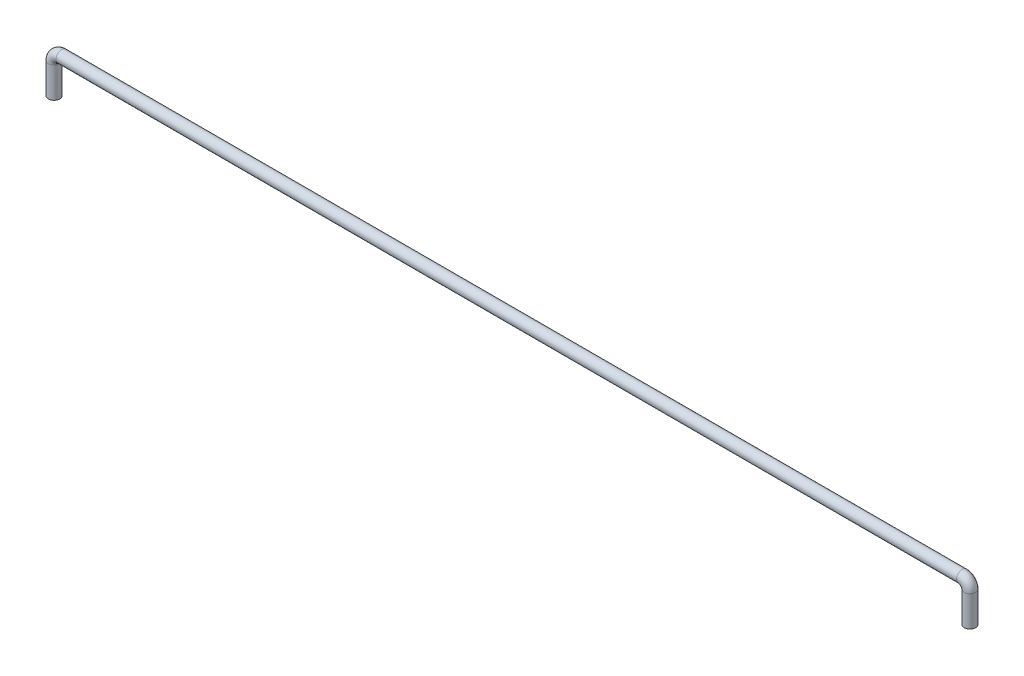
ISO-10303-21;
HEADER;
FILE_DESCRIPTION(('STEP AP214'),'2;1');
FILE_NAME('part.step','',(''),(''),'','','');
FILE_SCHEMA(('AUTOMOTIVE_DESIGN { 1 0 10303 214 1 1 1 1 }'));
ENDSEC;
DATA;
#1=APPLICATION_CONTEXT('core data for automotive mechanical design processes');
#2=APPLICATION_PROTOCOL_DEFINITION('international standard','automotive_design',2000,#1);
#3=PRODUCT_CONTEXT('',#1,'mechanical');
#4=PRODUCT('Part','Part','',(#3));
#5=PRODUCT_RELATED_PRODUCT_CATEGORY('part','',(#4));
#6=PRODUCT_DEFINITION_FORMATION('','',#4);
#7=PRODUCT_DEFINITION_CONTEXT('part definition',#1,'design');
#8=PRODUCT_DEFINITION('design','',#6,#7);
#9=PRODUCT_DEFINITION_SHAPE('','',#8);
#10=(LENGTH_UNIT() NAMED_UNIT(*) SI_UNIT(.MILLI.,.METRE.));
#11=(NAMED_UNIT(*) PLANE_ANGLE_UNIT() SI_UNIT($,.RADIAN.));
#12=(NAMED_UNIT(*) SI_UNIT($,.STERADIAN.) SOLID_ANGLE_UNIT());
#13=UNCERTAINTY_MEASURE_WITH_UNIT(LENGTH_MEASURE(1.E-05),#10,'distance_accuracy_value','');
#14=(GEOMETRIC_REPRESENTATION_CONTEXT(3) GLOBAL_UNCERTAINTY_ASSIGNED_CONTEXT((#13)) GLOBAL_UNIT_ASSIGNED_CONTEXT((#10,
#11,#12)) REPRESENTATION_CONTEXT('',''));
#15=CARTESIAN_POINT('',(0.,0.,0.));
#16=DIRECTION('',(0.,0.,1.));
#17=DIRECTION('',(1.,0.,0.));
#18=AXIS2_PLACEMENT_3D('',#15,#16,#17);
#19=CARTESIAN_POINT('',(60.,1.,-12.));
#20=DIRECTION('',(0.,-1.,0.));
#21=DIRECTION('',(0.,0.,-1.));
#22=AXIS2_PLACEMENT_3D('',#19,#20,#21);
#23=CYLINDRICAL_SURFACE('',#22,0.75);
#24=CARTESIAN_POINT('',(60.,1.,-12.));
#25=DIRECTION('',(0.,-1.,0.));
#26=DIRECTION('',(0.,0.,-1.));
#27=AXIS2_PLACEMENT_3D('',#24,#25,#26);
#28=CIRCLE('',#27,0.75);
#29=CARTESIAN_POINT('',(60.75,1.,-12.));
#30=VERTEX_POINT('',#29);
#31=EDGE_CURVE('E35',#30,#30,#28,.T.);
#32=ORIENTED_EDGE('',*,*,#31,.T.);
#33=EDGE_LOOP('',(#32));
#34=FACE_BOUND('',#33,.T.);
#35=CARTESIAN_POINT('',(60.,-3.,-12.));
#36=DIRECTION('',(0.,-1.,0.));
#37=DIRECTION('',(0.,0.,-1.));
#38=AXIS2_PLACEMENT_3D('',#35,#36,#37);
#39=CIRCLE('',#38,0.75);
#40=CARTESIAN_POINT('',(60.,-3.,-12.75));
#41=VERTEX_POINT('',#40);
#42=EDGE_CURVE('E10',#41,#41,#39,.T.);
#43=ORIENTED_EDGE('',*,*,#42,.F.);
#44=EDGE_LOOP('',(#43));
#45=FACE_BOUND('',#44,.T.);
#46=ADVANCED_FACE('F29',(#34,#45),#23,.T.);
#47=CARTESIAN_POINT('',(59.,1.,-12.));
#48=DIRECTION('',(0.,0.,-1.));
#49=DIRECTION('',(-1.,0.,0.));
#50=AXIS2_PLACEMENT_3D('',#47,#48,#49);
#51=TOROIDAL_SURFACE('',#50,1.,0.75);
#52=CARTESIAN_POINT('',(59.,2.,-12.));
#53=DIRECTION('',(1.,0.,0.));
#54=DIRECTION('',(0.,0.,-1.));
#55=AXIS2_PLACEMENT_3D('',#52,#53,#54);
#56=CIRCLE('',#55,0.75);
#57=CARTESIAN_POINT('',(59.,2.75,-12.));
#58=VERTEX_POINT('',#57);
#59=EDGE_CURVE('E39',#58,#58,#56,.T.);
#60=CARTESIAN_POINT('',(59.,1.,-12.));
#61=DIRECTION('',(0.,0.,-1.));
#62=DIRECTION('',(-1.,0.,0.));
#63=AXIS2_PLACEMENT_3D('',#60,#61,#62);
#64=CIRCLE('',#63,1.75);
#65=EDGE_CURVE('',#58,#30,#64,.T.);
#66=ORIENTED_EDGE('',*,*,#59,.T.);
#67=ORIENTED_EDGE('',*,*,#31,.F.);
#68=ORIENTED_EDGE('',*,*,#65,.T.);
#69=ORIENTED_EDGE('',*,*,#65,.F.);
#70=EDGE_LOOP('',(#66,#68,#67,#69));
#71=FACE_BOUND('',#70,.T.);
#72=ADVANCED_FACE('F74',(#71),#51,.T.);
#73=CARTESIAN_POINT('',(59.,2.,-12.));
#74=DIRECTION('',(-1.,0.,0.));
#75=DIRECTION('',(0.,-1.,0.));
#76=AXIS2_PLACEMENT_3D('',#73,#74,#75);
#77=CYLINDRICAL_SURFACE('',#76,0.75);
#78=ORIENTED_EDGE('',*,*,#59,.F.);
#79=EDGE_LOOP('',(#78));
#80=FACE_BOUND('',#79,.T.);
#81=CARTESIAN_POINT('',(-59.,2.,-12.));
#82=DIRECTION('',(1.,0.,0.));
#83=DIRECTION('',(0.,0.,-1.));
#84=AXIS2_PLACEMENT_3D('',#81,#82,#83);
#85=CIRCLE('',#84,0.75);
#86=CARTESIAN_POINT('',(-59.,2.75,-12.));
#87=VERTEX_POINT('',#86);
#88=EDGE_CURVE('E43',#87,#87,#85,.T.);
#89=ORIENTED_EDGE('',*,*,#88,.T.);
#90=EDGE_LOOP('',(#89));
#91=FACE_BOUND('',#90,.T.);
#92=ADVANCED_FACE('F78',(#80,#91),#77,.T.);
#93=CARTESIAN_POINT('',(60.,-3.,-12.));
#94=DIRECTION('',(0.,-1.,0.));
#95=DIRECTION('',(0.,0.,-1.));
#96=AXIS2_PLACEMENT_3D('',#93,#94,#95);
#97=PLANE('',#96);
#98=ORIENTED_EDGE('',*,*,#42,.T.);
#99=EDGE_LOOP('',(#98));
#100=FACE_BOUND('',#99,.T.);
#101=ADVANCED_FACE('F60',(#100),#97,.T.);
#102=CARTESIAN_POINT('',(-60.,1.,-12.));
#103=DIRECTION('',(0.,-1.,0.));
#104=DIRECTION('',(0.,0.,-1.));
#105=AXIS2_PLACEMENT_3D('',#102,#103,#104);
#106=CYLINDRICAL_SURFACE('',#105,0.75);
#107=CARTESIAN_POINT('',(-60.,1.,-12.));
#108=DIRECTION('',(0.,1.,0.));
#109=DIRECTION('',(0.,0.,-1.));
#110=AXIS2_PLACEMENT_3D('',#107,#108,#109);
#111=CIRCLE('',#110,0.75);
#112=CARTESIAN_POINT('',(-60.75,1.,-12.));
#113=VERTEX_POINT('',#112);
#114=EDGE_CURVE('E51',#113,#113,#111,.T.);
#115=ORIENTED_EDGE('',*,*,#114,.F.);
#116=EDGE_LOOP('',(#115));
#117=FACE_BOUND('',#116,.T.);
#118=CARTESIAN_POINT('',(-60.,-3.,-12.));
#119=DIRECTION('',(0.,1.,0.));
#120=DIRECTION('',(0.,0.,-1.));
#121=AXIS2_PLACEMENT_3D('',#118,#119,#120);
#122=CIRCLE('',#121,0.75);
#123=CARTESIAN_POINT('',(-60.,-3.,-12.75));
#124=VERTEX_POINT('',#123);
#125=EDGE_CURVE('E48',#124,#124,#122,.T.);
#126=ORIENTED_EDGE('',*,*,#125,.T.);
#127=EDGE_LOOP('',(#126));
#128=FACE_BOUND('',#127,.T.);
#129=ADVANCED_FACE('F57',(#117,#128),#106,.T.);
#130=CARTESIAN_POINT('',(-59.,1.,-12.));
#131=DIRECTION('',(0.,0.,-1.));
#132=DIRECTION('',(1.,0.,0.));
#133=AXIS2_PLACEMENT_3D('',#130,#131,#132);
#134=TOROIDAL_SURFACE('',#133,1.,0.75);
#135=CARTESIAN_POINT('',(-59.,1.,-12.));
#136=DIRECTION('',(0.,0.,-1.));
#137=DIRECTION('',(1.,0.,0.));
#138=AXIS2_PLACEMENT_3D('',#135,#136,#137);
#139=CIRCLE('',#138,1.75);
#140=EDGE_CURVE('',#113,#87,#139,.T.);
#141=ORIENTED_EDGE('',*,*,#114,.T.);
#142=ORIENTED_EDGE('',*,*,#88,.F.);
#143=ORIENTED_EDGE('',*,*,#140,.T.);
#144=ORIENTED_EDGE('',*,*,#140,.F.);
#145=EDGE_LOOP('',(#141,#143,#142,#144));
#146=FACE_BOUND('',#145,.T.);
#147=ADVANCED_FACE('F55',(#146),#134,.T.);
#148=CARTESIAN_POINT('',(-60.,-3.,-12.));
#149=DIRECTION('',(0.,-1.,0.));
#150=DIRECTION('',(0.,0.,-1.));
#151=AXIS2_PLACEMENT_3D('',#148,#149,#150);
#152=PLANE('',#151);
#153=ORIENTED_EDGE('',*,*,#125,.F.);
#154=EDGE_LOOP('',(#153));
#155=FACE_BOUND('',#154,.T.);
#156=ADVANCED_FACE('F64',(#155),#152,.T.);
#157=CLOSED_SHELL('',(#46,#72,#92,#101,#129,#147,#156));
#158=MANIFOLD_SOLID_BREP('B2',#157);
#159=ADVANCED_BREP_SHAPE_REPRESENTATION('',(#18,#158),#14);
#160=SHAPE_DEFINITION_REPRESENTATION(#9,#159);
ENDSEC;
END-ISO-10303-21;
